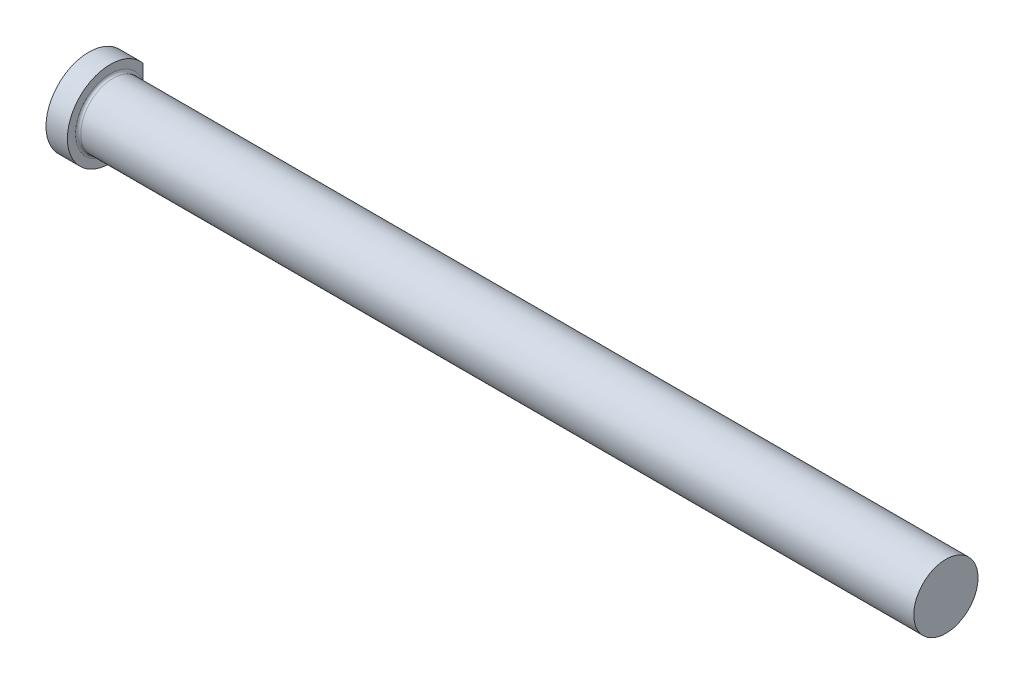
ISO-10303-21;
HEADER;
FILE_DESCRIPTION(('STEP AP214'),'2;1');
FILE_NAME('part.step','',(''),(''),'','','');
FILE_SCHEMA(('AUTOMOTIVE_DESIGN { 1 0 10303 214 1 1 1 1 }'));
ENDSEC;
DATA;
#1=APPLICATION_CONTEXT('core data for automotive mechanical design processes');
#2=APPLICATION_PROTOCOL_DEFINITION('international standard','automotive_design',2000,#1);
#3=PRODUCT_CONTEXT('',#1,'mechanical');
#4=PRODUCT('Part','Part','',(#3));
#5=PRODUCT_RELATED_PRODUCT_CATEGORY('part','',(#4));
#6=PRODUCT_DEFINITION_FORMATION('','',#4);
#7=PRODUCT_DEFINITION_CONTEXT('part definition',#1,'design');
#8=PRODUCT_DEFINITION('design','',#6,#7);
#9=PRODUCT_DEFINITION_SHAPE('','',#8);
#10=(LENGTH_UNIT() NAMED_UNIT(*) SI_UNIT(.MILLI.,.METRE.));
#11=(NAMED_UNIT(*) PLANE_ANGLE_UNIT() SI_UNIT($,.RADIAN.));
#12=(NAMED_UNIT(*) SI_UNIT($,.STERADIAN.) SOLID_ANGLE_UNIT());
#13=UNCERTAINTY_MEASURE_WITH_UNIT(LENGTH_MEASURE(1.E-05),#10,'distance_accuracy_value','');
#14=(GEOMETRIC_REPRESENTATION_CONTEXT(3) GLOBAL_UNCERTAINTY_ASSIGNED_CONTEXT((#13)) GLOBAL_UNIT_ASSIGNED_CONTEXT((#10,
#11,#12)) REPRESENTATION_CONTEXT('',''));
#15=CARTESIAN_POINT('',(0.,0.,0.));
#16=DIRECTION('',(0.,0.,1.));
#17=DIRECTION('',(1.,0.,0.));
#18=AXIS2_PLACEMENT_3D('',#15,#16,#17);
#19=CARTESIAN_POINT('',(0.,0.,0.));
#20=DIRECTION('',(1.,0.,0.));
#21=DIRECTION('',(0.,1.,0.));
#22=AXIS2_PLACEMENT_3D('',#19,#20,#21);
#23=PLANE('',#22);
#24=DIRECTION('',(0.,1.,0.));
#25=VECTOR('',#24,1.);
#26=CARTESIAN_POINT('',(0.,0.,-9.69644999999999));
#27=LINE('',#26,#25);
#28=CARTESIAN_POINT('',(0.,-8.20175940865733,-9.69644999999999));
#29=VERTEX_POINT('',#28);
#30=CARTESIAN_POINT('',(0.,8.20175940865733,-9.69644999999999));
#31=VERTEX_POINT('',#30);
#32=EDGE_CURVE('E49',#29,#31,#27,.T.);
#33=ORIENTED_EDGE('',*,*,#32,.F.);
#34=CARTESIAN_POINT('',(0.,0.,0.));
#35=DIRECTION('',(-1.,0.,0.));
#36=DIRECTION('',(0.,-1.,0.));
#37=AXIS2_PLACEMENT_3D('',#34,#35,#36);
#38=CIRCLE('',#37,12.7);
#39=EDGE_CURVE('E43',#29,#31,#38,.T.);
#40=ORIENTED_EDGE('',*,*,#39,.T.);
#41=EDGE_LOOP('',(#33,#40));
#42=FACE_BOUND('',#41,.T.);
#43=ADVANCED_FACE('F32',(#42),#23,.F.);
#44=CARTESIAN_POINT('',(254.,0.,0.));
#45=DIRECTION('',(-1.,0.,0.));
#46=DIRECTION('',(0.,-1.,0.));
#47=AXIS2_PLACEMENT_3D('',#44,#45,#46);
#48=CYLINDRICAL_SURFACE('',#47,12.7);
#49=DIRECTION('',(-1.,0.,0.));
#50=VECTOR('',#49,1.);
#51=CARTESIAN_POINT('',(254.,-8.20175940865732,-9.69645));
#52=LINE('',#51,#50);
#53=CARTESIAN_POINT('',(6.34999999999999,-8.20175940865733,-9.69645));
#54=VERTEX_POINT('',#53);
#55=EDGE_CURVE('E87',#54,#29,#52,.T.);
#56=ORIENTED_EDGE('',*,*,#55,.F.);
#57=CARTESIAN_POINT('',(6.34999999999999,0.,0.));
#58=DIRECTION('',(-1.,0.,0.));
#59=DIRECTION('',(0.,-1.,0.));
#60=AXIS2_PLACEMENT_3D('',#57,#58,#59);
#61=CIRCLE('',#60,12.7);
#62=CARTESIAN_POINT('',(6.34999999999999,8.20175940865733,-9.69644999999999));
#63=VERTEX_POINT('',#62);
#64=EDGE_CURVE('E75',#54,#63,#61,.T.);
#65=ORIENTED_EDGE('',*,*,#64,.T.);
#66=DIRECTION('',(-1.,0.,0.));
#67=VECTOR('',#66,1.);
#68=CARTESIAN_POINT('',(254.,8.20175940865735,-9.69644999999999));
#69=LINE('',#68,#67);
#70=EDGE_CURVE('E56',#31,#63,#69,.F.);
#71=ORIENTED_EDGE('',*,*,#70,.F.);
#72=ORIENTED_EDGE('',*,*,#39,.F.);
#73=EDGE_LOOP('',(#56,#65,#71,#72));
#74=FACE_BOUND('',#73,.T.);
#75=ADVANCED_FACE('F97',(#74),#48,.T.);
#76=CARTESIAN_POINT('',(6.35,12.7,0.));
#77=DIRECTION('',(-1.,0.,0.));
#78=DIRECTION('',(0.,-1.,0.));
#79=AXIS2_PLACEMENT_3D('',#76,#77,#78);
#80=PLANE('',#79);
#81=DIRECTION('',(0.,-1.,0.));
#82=VECTOR('',#81,1.);
#83=CARTESIAN_POINT('',(6.35,12.7,-9.69644999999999));
#84=LINE('',#83,#82);
#85=CARTESIAN_POINT('',(6.34999999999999,3.49192267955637,-9.69644999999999));
#86=VERTEX_POINT('',#85);
#87=EDGE_CURVE('E84',#63,#86,#84,.T.);
#88=ORIENTED_EDGE('',*,*,#87,.F.);
#89=ORIENTED_EDGE('',*,*,#64,.F.);
#90=CARTESIAN_POINT('',(6.34999999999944,-3.49192267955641,-9.69644999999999));
#91=VERTEX_POINT('',#90);
#92=EDGE_CURVE('E80',#91,#54,#84,.T.);
#93=ORIENTED_EDGE('',*,*,#92,.F.);
#94=CARTESIAN_POINT('',(6.34999999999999,0.,0.));
#95=DIRECTION('',(-1.,0.,0.));
#96=DIRECTION('',(0.,-1.,0.));
#97=AXIS2_PLACEMENT_3D('',#94,#95,#96);
#98=CIRCLE('',#97,10.30605);
#99=EDGE_CURVE('E70',#91,#86,#98,.T.);
#100=ORIENTED_EDGE('',*,*,#99,.T.);
#101=EDGE_LOOP('',(#88,#89,#93,#100));
#102=FACE_BOUND('',#101,.T.);
#103=ADVANCED_FACE('F81',(#102),#80,.F.);
#104=CARTESIAN_POINT('',(7.1374,0.,0.));
#105=DIRECTION('',(-1.,0.,0.));
#106=DIRECTION('',(0.,-1.,0.));
#107=AXIS2_PLACEMENT_3D('',#104,#105,#106);
#108=TOROIDAL_SURFACE('',#107,10.30605,0.7874);
#109=CARTESIAN_POINT('',(7.13739999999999,0.,0.));
#110=DIRECTION('',(-1.,0.,0.));
#111=DIRECTION('',(0.,-1.,0.));
#112=AXIS2_PLACEMENT_3D('',#109,#110,#111);
#113=CIRCLE('',#112,9.51865);
#114=CARTESIAN_POINT('',(7.13739999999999,-9.51865,0.));
#115=VERTEX_POINT('',#114);
#116=EDGE_CURVE('E76',#115,#115,#113,.T.);
#117=ORIENTED_EDGE('',*,*,#116,.T.);
#118=EDGE_LOOP('',(#117));
#119=FACE_BOUND('',#118,.T.);
#120=CARTESIAN_POINT('',(6.63901601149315,0.,-9.69644999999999));
#121=CARTESIAN_POINT('',(6.63901576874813,-0.131334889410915,-9.69644999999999));
#122=CARTESIAN_POINT('',(6.63569367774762,-0.262669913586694,-9.69644999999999));
#123=CARTESIAN_POINT('',(6.62309169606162,-0.525061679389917,-9.69644999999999));
#124=CARTESIAN_POINT('',(6.61381056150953,-0.656118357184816,-9.69644999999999));
#125=CARTESIAN_POINT('',(6.59089030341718,-0.91859489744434,-9.69644999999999));
#126=CARTESIAN_POINT('',(6.57722622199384,-1.05001245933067,-9.69644999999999));
#127=CARTESIAN_POINT('',(6.54752507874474,-1.31256416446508,-9.69644999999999));
#128=CARTESIAN_POINT('',(6.5314880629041,-1.44369831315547,-9.69644999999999));
#129=CARTESIAN_POINT('',(6.49099253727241,-1.76947250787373,-9.69644999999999));
#130=CARTESIAN_POINT('',(6.46622117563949,-1.96407343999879,-9.69644999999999));
#131=CARTESIAN_POINT('',(6.42077096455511,-2.35389547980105,-9.69644999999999));
#132=CARTESIAN_POINT('',(6.40009460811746,-2.54911689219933,-9.69644999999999));
#133=CARTESIAN_POINT('',(6.36779284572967,-2.9397438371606,-9.69644999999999));
#134=CARTESIAN_POINT('',(6.35613645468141,-3.13514640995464,-9.69644999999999));
#135=CARTESIAN_POINT('',(6.34966327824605,-3.42840089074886,-9.69644999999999));
#136=CARTESIAN_POINT('',(6.34933787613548,-3.52612238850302,-9.69644999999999));
#137=CARTESIAN_POINT('',(6.35328475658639,-3.72146247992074,-9.69644999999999));
#138=CARTESIAN_POINT('',(6.35755549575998,-3.81908109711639,-9.69644999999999));
#139=CARTESIAN_POINT('',(6.36978515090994,-3.98560714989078,-9.69644999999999));
#140=CARTESIAN_POINT('',(6.37631253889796,-4.05461846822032,-9.69644999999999));
#141=CARTESIAN_POINT('',(6.39282059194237,-4.19226800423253,-9.69644999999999));
#142=CARTESIAN_POINT('',(6.40280265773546,-4.26090605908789,-9.69644999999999));
#143=CARTESIAN_POINT('',(6.42687360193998,-4.3972333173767,-9.69644999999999));
#144=CARTESIAN_POINT('',(6.44094853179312,-4.46492493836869,-9.69644999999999));
#145=CARTESIAN_POINT('',(6.47412512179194,-4.59904233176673,-9.69644999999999));
#146=CARTESIAN_POINT('',(6.49322213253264,-4.66546921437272,-9.69645));
#147=CARTESIAN_POINT('',(6.53101824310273,-4.77646480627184,-9.69645));
#148=CARTESIAN_POINT('',(6.54809873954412,-4.821581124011,-9.69645));
#149=CARTESIAN_POINT('',(6.5859792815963,-4.91032685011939,-9.69645));
#150=CARTESIAN_POINT('',(6.60678419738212,-4.95395422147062,-9.69645));
#151=CARTESIAN_POINT('',(6.65305798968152,-5.03914305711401,-9.69645));
#152=CARTESIAN_POINT('',(6.67856206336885,-5.08068569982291,-9.69645));
#153=CARTESIAN_POINT('',(6.73513723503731,-5.1598033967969,-9.69645));
#154=CARTESIAN_POINT('',(6.76619307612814,-5.1973888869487,-9.69645));
#155=CARTESIAN_POINT('',(6.82043462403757,-5.25143793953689,-9.69645));
#156=CARTESIAN_POINT('',(6.84140095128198,-5.2701157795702,-9.69645));
#157=CARTESIAN_POINT('',(6.88572156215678,-5.30445571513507,-9.69645));
#158=CARTESIAN_POINT('',(6.90907597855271,-5.32011764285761,-9.69645));
#159=CARTESIAN_POINT('',(6.95842982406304,-5.34755452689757,-9.69645));
#160=CARTESIAN_POINT('',(6.98446038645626,-5.35927483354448,-9.69645));
#161=CARTESIAN_POINT('',(7.0383319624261,-5.37729012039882,-9.69645));
#162=CARTESIAN_POINT('',(7.06616867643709,-5.38359751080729,-9.69645));
#163=CARTESIAN_POINT('',(7.11861133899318,-5.3895133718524,-9.69645));
#164=CARTESIAN_POINT('',(7.14312612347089,-5.38993375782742,-9.69645));
#165=CARTESIAN_POINT('',(7.19179040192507,-5.38610574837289,-9.69645));
#166=CARTESIAN_POINT('',(7.21593980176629,-5.38185616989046,-9.69645));
#167=CARTESIAN_POINT('',(7.26056342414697,-5.36982537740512,-9.69645));
#168=CARTESIAN_POINT('',(7.28115547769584,-5.36246747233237,-9.69645));
#169=CARTESIAN_POINT('',(7.32107376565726,-5.34491360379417,-9.69645));
#170=CARTESIAN_POINT('',(7.34039977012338,-5.33471712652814,-9.69645));
#171=CARTESIAN_POINT('',(7.38913644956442,-5.30501388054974,-9.69645));
#172=CARTESIAN_POINT('',(7.41741023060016,-5.28364480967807,-9.69645));
#173=CARTESIAN_POINT('',(7.47031071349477,-5.23678376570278,-9.69645));
#174=CARTESIAN_POINT('',(7.49492590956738,-5.21127929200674,-9.69645));
#175=CARTESIAN_POINT('',(7.5572725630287,-5.13831274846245,-9.69645));
#176=CARTESIAN_POINT('',(7.59183361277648,-5.08816630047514,-9.69645));
#177=CARTESIAN_POINT('',(7.65346183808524,-4.98353200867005,-9.69645));
#178=CARTESIAN_POINT('',(7.68050999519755,-4.92903358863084,-9.69645));
#179=CARTESIAN_POINT('',(7.72936538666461,-4.81602696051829,-9.69645));
#180=CARTESIAN_POINT('',(7.7510113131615,-4.75745020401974,-9.69644999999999));
#181=CARTESIAN_POINT('',(7.78936243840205,-4.63867498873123,-9.69644999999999));
#182=CARTESIAN_POINT('',(7.80606234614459,-4.57847486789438,-9.69644999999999));
#183=CARTESIAN_POINT('',(7.83542349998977,-4.45703685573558,-9.69644999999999));
#184=CARTESIAN_POINT('',(7.84807976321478,-4.39579778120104,-9.69644999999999));
#185=CARTESIAN_POINT('',(7.87000608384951,-4.27270556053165,-9.69644999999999));
#186=CARTESIAN_POINT('',(7.87927487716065,-4.21085219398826,-9.69644999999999));
#187=CARTESIAN_POINT('',(7.89601954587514,-4.07827166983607,-9.69644999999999));
#188=CARTESIAN_POINT('',(7.90307454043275,-4.00749212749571,-9.69644999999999));
#189=CARTESIAN_POINT('',(7.91407245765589,-3.86568613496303,-9.69644999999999));
#190=CARTESIAN_POINT('',(7.91801466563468,-3.79465963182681,-9.69644999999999));
#191=CARTESIAN_POINT('',(7.92591154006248,-3.58131316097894,-9.69644999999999));
#192=CARTESIAN_POINT('',(7.92592303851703,-3.43884695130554,-9.69644999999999));
#193=CARTESIAN_POINT('',(7.91836277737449,-3.15372342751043,-9.69644999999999));
#194=CARTESIAN_POINT('',(7.91076657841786,-3.01106697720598,-9.69644999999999));
#195=CARTESIAN_POINT('',(7.89020648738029,-2.72624866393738,-9.69644999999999));
#196=CARTESIAN_POINT('',(7.87724592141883,-2.58408654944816,-9.69644999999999));
#197=CARTESIAN_POINT('',(7.84058594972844,-2.22939512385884,-9.69644999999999));
#198=CARTESIAN_POINT('',(7.81475345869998,-2.01709889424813,-9.69644999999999));
#199=CARTESIAN_POINT('',(7.77510364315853,-1.69870824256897,-9.69644999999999));
#200=CARTESIAN_POINT('',(7.76173202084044,-1.59254983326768,-9.69644999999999));
#201=CARTESIAN_POINT('',(7.73559724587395,-1.38015912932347,-9.69644999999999));
#202=CARTESIAN_POINT('',(7.72283410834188,-1.27392683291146,-9.69644999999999));
#203=CARTESIAN_POINT('',(7.68714717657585,-0.956499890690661,-9.69644999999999));
#204=CARTESIAN_POINT('',(7.66659886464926,-0.744990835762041,-9.69644999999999));
#205=CARTESIAN_POINT('',(7.64646504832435,-0.427145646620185,-9.69644999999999));
#206=CARTESIAN_POINT('',(7.64153497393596,-0.321164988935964,-9.69644999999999));
#207=CARTESIAN_POINT('',(7.63584195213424,-0.109092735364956,-9.69644999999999));
#208=CARTESIAN_POINT('',(7.63507878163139,-0.0030011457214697,-9.69644999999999));
#209=CARTESIAN_POINT('',(7.63776398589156,0.204220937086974,-9.69644999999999));
#210=CARTESIAN_POINT('',(7.64101933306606,0.305354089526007,-9.69644999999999));
#211=CARTESIAN_POINT('',(7.65101817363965,0.507448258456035,-9.69644999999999));
#212=CARTESIAN_POINT('',(7.6577618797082,0.608409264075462,-9.69644999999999));
#213=CARTESIAN_POINT('',(7.68215757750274,0.911188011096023,-9.69644999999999));
#214=CARTESIAN_POINT('',(7.70396781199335,1.11265414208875,-9.69644999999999));
#215=CARTESIAN_POINT('',(7.75179507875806,1.51651999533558,-9.69644999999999));
#216=CARTESIAN_POINT('',(7.77784191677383,1.71891566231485,-9.69644999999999));
#217=CARTESIAN_POINT('',(7.82767572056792,2.12388033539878,-9.69644999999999));
#218=CARTESIAN_POINT('',(7.85146425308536,2.32644912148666,-9.69644999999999));
#219=CARTESIAN_POINT('',(7.88316262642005,2.64971578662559,-9.69644999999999));
#220=CARTESIAN_POINT('',(7.89359358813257,2.77015696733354,-9.69644999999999));
#221=CARTESIAN_POINT('',(7.91052719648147,3.01137425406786,-9.69644999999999));
#222=CARTESIAN_POINT('',(7.9170283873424,3.13215046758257,-9.69644999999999));
#223=CARTESIAN_POINT('',(7.92471071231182,3.37325531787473,-9.69644999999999));
#224=CARTESIAN_POINT('',(7.92591957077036,3.49358297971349,-9.69644999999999));
#225=CARTESIAN_POINT('',(7.92144474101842,3.73408481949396,-9.69644999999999));
#226=CARTESIAN_POINT('',(7.91576535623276,3.85425904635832,-9.69644999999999));
#227=CARTESIAN_POINT('',(7.89808281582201,4.06100539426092,-9.69644999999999));
#228=CARTESIAN_POINT('',(7.88823990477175,4.14775837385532,-9.69644999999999));
#229=CARTESIAN_POINT('',(7.862479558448,4.32085682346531,-9.69644999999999));
#230=CARTESIAN_POINT('',(7.84653179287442,4.40719804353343,-9.69644999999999));
#231=CARTESIAN_POINT('',(7.81386532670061,4.54789086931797,-9.69644999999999));
#232=CARTESIAN_POINT('',(7.7994103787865,4.60276536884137,-9.69644999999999));
#233=CARTESIAN_POINT('',(7.76656944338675,4.71141379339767,-9.69644999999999));
#234=CARTESIAN_POINT('',(7.7481793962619,4.76518651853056,-9.69644999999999));
#235=CARTESIAN_POINT('',(7.70674591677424,4.87054756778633,-9.69644999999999));
#236=CARTESIAN_POINT('',(7.68373253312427,4.92214752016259,-9.69644999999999));
#237=CARTESIAN_POINT('',(7.63185783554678,5.02226478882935,-9.69644999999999));
#238=CARTESIAN_POINT('',(7.60301235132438,5.07078999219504,-9.69644999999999));
#239=CARTESIAN_POINT('',(7.54664883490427,5.15031473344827,-9.69644999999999));
#240=CARTESIAN_POINT('',(7.52085437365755,5.18252134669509,-9.69644999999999));
#241=CARTESIAN_POINT('',(7.46461013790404,5.24257489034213,-9.69644999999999));
#242=CARTESIAN_POINT('',(7.4341757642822,5.27043564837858,-9.69644999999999));
#243=CARTESIAN_POINT('',(7.38060873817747,5.3101736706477,-9.69644999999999));
#244=CARTESIAN_POINT('',(7.35902426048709,5.32412477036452,-9.69644999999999));
#245=CARTESIAN_POINT('',(7.31394468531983,5.34855487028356,-9.69644999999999));
#246=CARTESIAN_POINT('',(7.29045059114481,5.35903567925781,-9.69644999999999));
#247=CARTESIAN_POINT('',(7.24166974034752,5.37573176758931,-9.69644999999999));
#248=CARTESIAN_POINT('',(7.21636627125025,5.38189943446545,-9.69644999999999));
#249=CARTESIAN_POINT('',(7.16504271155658,5.38906457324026,-9.69644999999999));
#250=CARTESIAN_POINT('',(7.13902350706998,5.39006817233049,-9.69644999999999));
#251=CARTESIAN_POINT('',(7.09098675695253,5.3870311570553,-9.69644999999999));
#252=CARTESIAN_POINT('',(7.06892190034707,5.38368130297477,-9.69644999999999));
#253=CARTESIAN_POINT('',(7.02564528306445,5.37340491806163,-9.69644999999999));
#254=CARTESIAN_POINT('',(7.00443403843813,5.36647625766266,-9.69644999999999));
#255=CARTESIAN_POINT('',(6.95695041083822,5.34695692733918,-9.69644999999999));
#256=CARTESIAN_POINT('',(6.93112740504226,5.33328033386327,-9.69644999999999));
#257=CARTESIAN_POINT('',(6.882012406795,5.3019712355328,-9.69644999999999));
#258=CARTESIAN_POINT('',(6.8587257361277,5.28433064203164,-9.69644999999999));
#259=CARTESIAN_POINT('',(6.80225762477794,5.23543941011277,-9.69644999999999));
#260=CARTESIAN_POINT('',(6.77088547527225,5.20211741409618,-9.69644999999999));
#261=CARTESIAN_POINT('',(6.7134336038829,5.1312251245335,-9.69644999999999));
#262=CARTESIAN_POINT('',(6.68736700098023,5.09364464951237,-9.69644999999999));
#263=CARTESIAN_POINT('',(6.64095855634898,5.01797575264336,-9.69644999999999));
#264=CARTESIAN_POINT('',(6.62038014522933,4.98002985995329,-9.69644999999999));
#265=CARTESIAN_POINT('',(6.58250086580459,4.90251759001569,-9.69644999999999));
#266=CARTESIAN_POINT('',(6.56520303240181,4.86294975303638,-9.69644999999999));
#267=CARTESIAN_POINT('',(6.53336451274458,4.78264447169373,-9.69644999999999));
#268=CARTESIAN_POINT('',(6.51882922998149,4.74190491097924,-9.69644999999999));
#269=CARTESIAN_POINT('',(6.49216159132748,4.65967321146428,-9.69644999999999));
#270=CARTESIAN_POINT('',(6.48002834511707,4.61818135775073,-9.69644999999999));
#271=CARTESIAN_POINT('',(6.45341019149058,4.51800273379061,-9.69644999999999));
#272=CARTESIAN_POINT('',(6.43991528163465,4.45905354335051,-9.69644999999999));
#273=CARTESIAN_POINT('',(6.41629981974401,4.34047511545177,-9.69644999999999));
#274=CARTESIAN_POINT('',(6.40618075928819,4.28084558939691,-9.69644999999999));
#275=CARTESIAN_POINT('',(6.38006447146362,4.10115364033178,-9.69644999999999));
#276=CARTESIAN_POINT('',(6.36835181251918,3.98046692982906,-9.69644999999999));
#277=CARTESIAN_POINT('',(6.35332662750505,3.73812791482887,-9.69644999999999));
#278=CARTESIAN_POINT('',(6.35005130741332,3.6164736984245,-9.69644999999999));
#279=CARTESIAN_POINT('',(6.34994990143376,3.37312773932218,-9.69644999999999));
#280=CARTESIAN_POINT('',(6.35312684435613,3.25143600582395,-9.69644999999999));
#281=CARTESIAN_POINT('',(6.36479593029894,2.99859961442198,-9.69644999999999));
#282=CARTESIAN_POINT('',(6.3736918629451,2.8674752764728,-9.69644999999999));
#283=CARTESIAN_POINT('',(6.39550909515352,2.60555532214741,-9.69644999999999));
#284=CARTESIAN_POINT('',(6.40843109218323,2.47475976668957,-9.69644999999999));
#285=CARTESIAN_POINT('',(6.43682885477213,2.21322922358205,-9.69644999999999));
#286=CARTESIAN_POINT('',(6.45230895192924,2.08249472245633,-9.69644999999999));
#287=CARTESIAN_POINT('',(6.48430402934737,1.82116462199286,-9.69644999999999));
#288=CARTESIAN_POINT('',(6.5008189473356,1.69056901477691,-9.69644999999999));
#289=CARTESIAN_POINT('',(6.5331308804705,1.43032183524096,-9.69644999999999));
#290=CARTESIAN_POINT('',(6.54893249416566,1.30067085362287,-9.69644999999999));
#291=CARTESIAN_POINT('',(6.57816848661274,1.0410904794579,-9.69644999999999));
#292=CARTESIAN_POINT('',(6.59160286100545,0.91116108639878,-9.69644999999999));
#293=CARTESIAN_POINT('',(6.61417743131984,0.6511622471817,-9.69644999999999));
#294=CARTESIAN_POINT('',(6.62332587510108,0.521093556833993,-9.69644999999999));
#295=CARTESIAN_POINT('',(6.63574469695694,0.260683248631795,-9.69644999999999));
#296=CARTESIAN_POINT('',(6.63901625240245,0.130341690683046,-9.69644999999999));
#297=CARTESIAN_POINT('',(6.63901601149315,0.,-9.69644999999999));
#298=B_SPLINE_CURVE_WITH_KNOTS('',3,(#120,#121,#122,#123,#124,#125,#126,#127,#128,#129,#130,
#131,#132,#133,#134,#135,#136,#137,#138,#139,#140,#141,#142,#143,#144,#145,#146,#147,#148,#149,
#150,#151,#152,#153,#154,#155,#156,#157,#158,#159,#160,#161,#162,#163,#164,#165,#166,#167,#168,
#169,#170,#171,#172,#173,#174,#175,#176,#177,#178,#179,#180,#181,#182,#183,#184,#185,#186,#187,
#188,#189,#190,#191,#192,#193,#194,#195,#196,#197,#198,#199,#200,#201,#202,#203,#204,#205,#206,
#207,#208,#209,#210,#211,#212,#213,#214,#215,#216,#217,#218,#219,#220,#221,#222,#223,#224,#225,
#226,#227,#228,#229,#230,#231,#232,#233,#234,#235,#236,#237,#238,#239,#240,#241,#242,#243,#244,
#245,#246,#247,#248,#249,#250,#251,#252,#253,#254,#255,#256,#257,#258,#259,#260,#261,#262,#263,
#264,#265,#266,#267,#268,#269,#270,#271,#272,#273,#274,#275,#276,#277,#278,#279,#280,#281,#282,
#283,#284,#285,#286,#287,#288,#289,#290,#291,#292,#293,#294,#295,#296,#297),.UNSPECIFIED.,.T.,
.F.,(4,2,2,2,2,2,2,2,2,2,2,2,2,2,2,2,2,2,2,2,2,2,2,2,2,2,2,2,2,2,2,2,2,2,2,2,2,2,2,2,2,2,2,2,2,
2,2,2,2,2,2,2,2,2,2,2,2,2,2,2,2,2,2,2,2,2,2,2,2,2,2,2,2,2,2,2,2,2,2,2,2,2,2,2,2,2,2,2,4),(0.,
0.39396963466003,0.78802153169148,1.18435835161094,1.58068749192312,2.16919546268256,
2.7580606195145,3.34489383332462,3.63798037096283,3.93096852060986,4.138857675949,
4.34683122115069,4.55410413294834,4.76118582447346,4.90578374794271,5.05057215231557,
5.19649271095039,5.34201826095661,5.42605253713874,5.51009148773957,5.59525171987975,
5.68021617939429,5.75332535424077,5.82645305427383,5.89180930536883,5.95717739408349,
6.06288679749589,6.16892191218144,6.35060200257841,6.53273789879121,6.71979376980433,
6.90704902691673,7.0945341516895,7.28208916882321,7.49539481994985,7.70874943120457,
8.13582202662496,8.56427098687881,8.99245468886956,9.63398906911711,9.95498100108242,
10.2759809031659,10.9131788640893,11.2313907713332,11.5495856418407,11.8530735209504,
12.1565799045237,12.764333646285,13.3765643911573,13.9883672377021,14.3509981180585,
14.7137632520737,15.0746257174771,15.4352628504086,15.6970416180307,15.9601382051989,
16.1302660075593,16.3005701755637,16.4698013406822,16.6385791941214,16.7620347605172,
16.8850891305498,16.9619467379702,17.0387642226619,17.1164168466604,17.1939773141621,
17.2606102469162,17.3272828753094,17.4144575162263,17.5018116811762,17.6383403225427,
17.7752025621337,17.9045105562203,18.0339375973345,18.1636152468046,18.2932447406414,
18.474537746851,18.6559107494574,19.0192072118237,19.384102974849,19.7491700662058,
20.1433594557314,20.5376171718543,20.9325494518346,21.3274579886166,21.719283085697,
22.1111089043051,22.5021775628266,22.8931678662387),.UNSPECIFIED.);
#299=EDGE_CURVE('E12',#86,#91,#298,.T.);
#300=ORIENTED_EDGE('',*,*,#299,.F.);
#301=ORIENTED_EDGE('',*,*,#99,.F.);
#302=EDGE_LOOP('',(#300,#301));
#303=FACE_BOUND('',#302,.T.);
#304=ADVANCED_FACE('F72',(#119,#303),#108,.F.);
#305=CARTESIAN_POINT('',(254.,0.,0.));
#306=DIRECTION('',(-1.,0.,0.));
#307=DIRECTION('',(0.,-1.,0.));
#308=AXIS2_PLACEMENT_3D('',#305,#306,#307);
#309=CYLINDRICAL_SURFACE('',#308,9.51864999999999);
#310=ORIENTED_EDGE('',*,*,#116,.F.);
#311=EDGE_LOOP('',(#310));
#312=FACE_BOUND('',#311,.T.);
#313=CARTESIAN_POINT('',(254.,0.,0.));
#314=DIRECTION('',(-1.,0.,0.));
#315=DIRECTION('',(0.,-1.,0.));
#316=AXIS2_PLACEMENT_3D('',#313,#314,#315);
#317=CIRCLE('',#316,9.51864999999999);
#318=CARTESIAN_POINT('',(254.,-9.51864999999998,0.));
#319=VERTEX_POINT('',#318);
#320=EDGE_CURVE('E92',#319,#319,#317,.T.);
#321=ORIENTED_EDGE('',*,*,#320,.T.);
#322=EDGE_LOOP('',(#321));
#323=FACE_BOUND('',#322,.T.);
#324=ADVANCED_FACE('F107',(#312,#323),#309,.T.);
#325=CARTESIAN_POINT('',(254.,9.51865,0.));
#326=DIRECTION('',(-1.,0.,0.));
#327=DIRECTION('',(0.,-1.,0.));
#328=AXIS2_PLACEMENT_3D('',#325,#326,#327);
#329=PLANE('',#328);
#330=ORIENTED_EDGE('',*,*,#320,.F.);
#331=EDGE_LOOP('',(#330));
#332=FACE_BOUND('',#331,.T.);
#333=ADVANCED_FACE('F111',(#332),#329,.F.);
#334=CARTESIAN_POINT('',(0.,0.,-9.69644999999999));
#335=DIRECTION('',(0.,0.,-1.));
#336=DIRECTION('',(0.,1.,0.));
#337=AXIS2_PLACEMENT_3D('',#334,#335,#336);
#338=PLANE('',#337);
#339=ORIENTED_EDGE('',*,*,#55,.T.);
#340=ORIENTED_EDGE('',*,*,#32,.T.);
#341=ORIENTED_EDGE('',*,*,#70,.T.);
#342=ORIENTED_EDGE('',*,*,#87,.T.);
#343=ORIENTED_EDGE('',*,*,#299,.T.);
#344=ORIENTED_EDGE('',*,*,#92,.T.);
#345=EDGE_LOOP('',(#339,#340,#341,#342,#343,#344));
#346=FACE_BOUND('',#345,.T.);
#347=ADVANCED_FACE('F86',(#346),#338,.T.);
#348=CLOSED_SHELL('',(#43,#75,#103,#304,#324,#333,#347));
#349=MANIFOLD_SOLID_BREP('B2',#348);
#350=ADVANCED_BREP_SHAPE_REPRESENTATION('',(#18,#349),#14);
#351=SHAPE_DEFINITION_REPRESENTATION(#9,#350);
ENDSEC;
END-ISO-10303-21;
